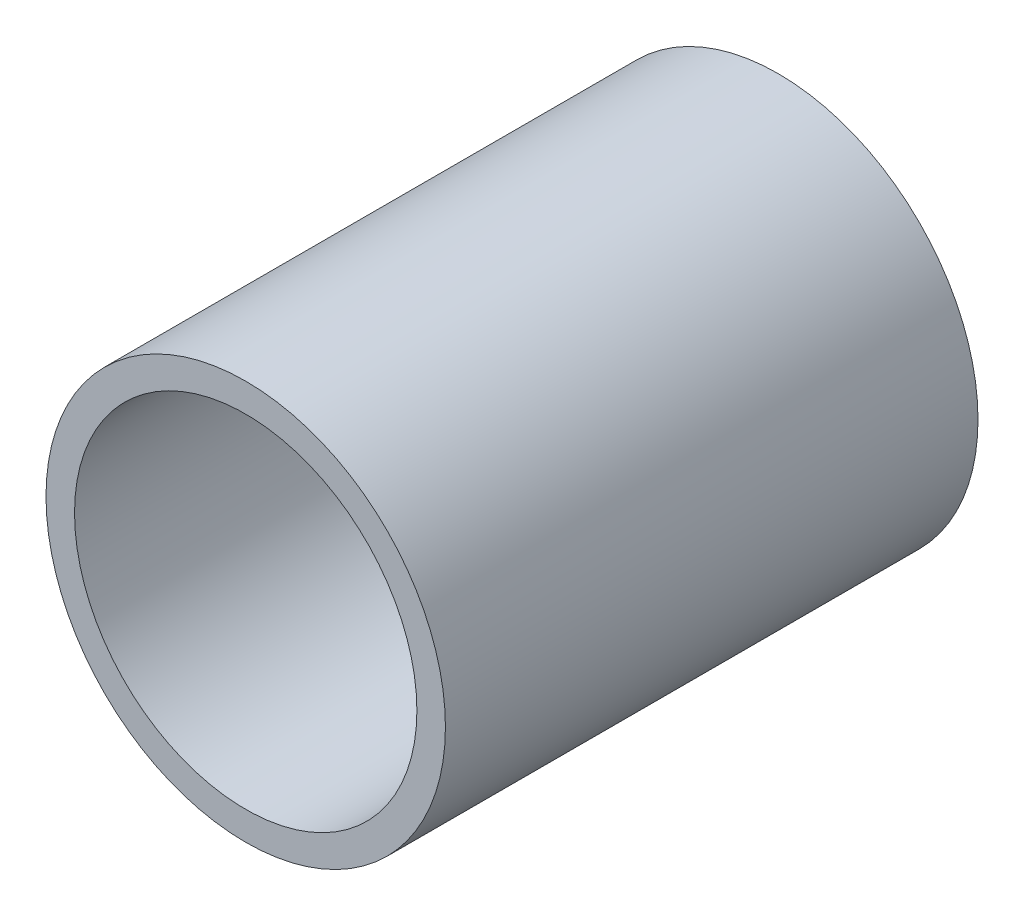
ISO-10303-21;
HEADER;
FILE_DESCRIPTION(('STEP AP214'),'2;1');
FILE_NAME('part.step','',(''),(''),'','','');
FILE_SCHEMA(('AUTOMOTIVE_DESIGN { 1 0 10303 214 1 1 1 1 }'));
ENDSEC;
DATA;
#1=APPLICATION_CONTEXT('core data for automotive mechanical design processes');
#2=APPLICATION_PROTOCOL_DEFINITION('international standard','automotive_design',2000,#1);
#3=PRODUCT_CONTEXT('',#1,'mechanical');
#4=PRODUCT('Part','Part','',(#3));
#5=PRODUCT_RELATED_PRODUCT_CATEGORY('part','',(#4));
#6=PRODUCT_DEFINITION_FORMATION('','',#4);
#7=PRODUCT_DEFINITION_CONTEXT('part definition',#1,'design');
#8=PRODUCT_DEFINITION('design','',#6,#7);
#9=PRODUCT_DEFINITION_SHAPE('','',#8);
#10=(LENGTH_UNIT() NAMED_UNIT(*) SI_UNIT(.MILLI.,.METRE.));
#11=(NAMED_UNIT(*) PLANE_ANGLE_UNIT() SI_UNIT($,.RADIAN.));
#12=(NAMED_UNIT(*) SI_UNIT($,.STERADIAN.) SOLID_ANGLE_UNIT());
#13=UNCERTAINTY_MEASURE_WITH_UNIT(LENGTH_MEASURE(1.E-05),#10,'distance_accuracy_value','');
#14=(GEOMETRIC_REPRESENTATION_CONTEXT(3) GLOBAL_UNCERTAINTY_ASSIGNED_CONTEXT((#13)) GLOBAL_UNIT_ASSIGNED_CONTEXT((#10,
#11,#12)) REPRESENTATION_CONTEXT('',''));
#15=CARTESIAN_POINT('',(0.,0.,0.));
#16=DIRECTION('',(0.,0.,1.));
#17=DIRECTION('',(1.,0.,0.));
#18=AXIS2_PLACEMENT_3D('',#15,#16,#17);
#19=CARTESIAN_POINT('',(-4.5,0.,-57.698484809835));
#20=DIRECTION('',(0.,0.,1.));
#21=DIRECTION('',(1.,0.,0.));
#22=AXIS2_PLACEMENT_3D('',#19,#20,#21);
#23=CYLINDRICAL_SURFACE('',#22,10.5);
#24=CARTESIAN_POINT('',(-4.5,0.,-28.));
#25=DIRECTION('',(0.,0.,1.));
#26=DIRECTION('',(1.,0.,0.));
#27=AXIS2_PLACEMENT_3D('',#24,#25,#26);
#28=CIRCLE('',#27,10.5);
#29=CARTESIAN_POINT('',(6.,0.,-28.));
#30=VERTEX_POINT('',#29);
#31=EDGE_CURVE('E10',#30,#30,#28,.F.);
#32=ORIENTED_EDGE('',*,*,#31,.F.);
#33=EDGE_LOOP('',(#32));
#34=FACE_BOUND('',#33,.T.);
#35=CARTESIAN_POINT('',(-4.5,0.,0.));
#36=DIRECTION('',(0.,0.,1.));
#37=DIRECTION('',(1.,0.,0.));
#38=AXIS2_PLACEMENT_3D('',#35,#36,#37);
#39=CIRCLE('',#38,10.5);
#40=CARTESIAN_POINT('',(6.,0.,0.));
#41=VERTEX_POINT('',#40);
#42=EDGE_CURVE('E40',#41,#41,#39,.T.);
#43=ORIENTED_EDGE('',*,*,#42,.F.);
#44=EDGE_LOOP('',(#43));
#45=FACE_BOUND('',#44,.T.);
#46=ADVANCED_FACE('F29',(#34,#45),#23,.T.);
#47=CARTESIAN_POINT('',(-4.5,0.,0.));
#48=DIRECTION('',(0.,0.,1.));
#49=DIRECTION('',(1.,0.,0.));
#50=AXIS2_PLACEMENT_3D('',#47,#48,#49);
#51=PLANE('',#50);
#52=CARTESIAN_POINT('',(-4.5,0.,0.));
#53=DIRECTION('',(0.,0.,1.));
#54=DIRECTION('',(1.,0.,0.));
#55=AXIS2_PLACEMENT_3D('',#52,#53,#54);
#56=CIRCLE('',#55,9.);
#57=CARTESIAN_POINT('',(4.5,0.,0.));
#58=VERTEX_POINT('',#57);
#59=EDGE_CURVE('E42',#58,#58,#56,.T.);
#60=ORIENTED_EDGE('',*,*,#59,.F.);
#61=EDGE_LOOP('',(#60));
#62=FACE_BOUND('',#61,.T.);
#63=ORIENTED_EDGE('',*,*,#42,.T.);
#64=EDGE_LOOP('',(#63));
#65=FACE_BOUND('',#64,.T.);
#66=ADVANCED_FACE('F47',(#62,#65),#51,.T.);
#67=CARTESIAN_POINT('',(-4.5,0.,-57.698484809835));
#68=DIRECTION('',(0.,0.,1.));
#69=DIRECTION('',(1.,0.,0.));
#70=AXIS2_PLACEMENT_3D('',#67,#68,#69);
#71=CYLINDRICAL_SURFACE('',#70,9.);
#72=CARTESIAN_POINT('',(-4.5,0.,-28.));
#73=DIRECTION('',(0.,0.,1.));
#74=DIRECTION('',(1.,0.,0.));
#75=AXIS2_PLACEMENT_3D('',#72,#73,#74);
#76=CIRCLE('',#75,9.);
#77=CARTESIAN_POINT('',(4.5,0.,-28.));
#78=VERTEX_POINT('',#77);
#79=EDGE_CURVE('E32',#78,#78,#76,.F.);
#80=ORIENTED_EDGE('',*,*,#79,.T.);
#81=EDGE_LOOP('',(#80));
#82=FACE_BOUND('',#81,.T.);
#83=ORIENTED_EDGE('',*,*,#59,.T.);
#84=EDGE_LOOP('',(#83));
#85=FACE_BOUND('',#84,.T.);
#86=ADVANCED_FACE('F54',(#82,#85),#71,.F.);
#87=CARTESIAN_POINT('',(17.7881605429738,12.9154887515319,-28.));
#88=DIRECTION('',(0.,0.,1.));
#89=DIRECTION('',(1.,0.,0.));
#90=AXIS2_PLACEMENT_3D('',#87,#88,#89);
#91=PLANE('',#90);
#92=ORIENTED_EDGE('',*,*,#31,.T.);
#93=EDGE_LOOP('',(#92));
#94=FACE_BOUND('',#93,.T.);
#95=ORIENTED_EDGE('',*,*,#79,.F.);
#96=EDGE_LOOP('',(#95));
#97=FACE_BOUND('',#96,.T.);
#98=ADVANCED_FACE('F59',(#94,#97),#91,.F.);
#99=CLOSED_SHELL('',(#46,#66,#86,#98));
#100=MANIFOLD_SOLID_BREP('B2',#99);
#101=ADVANCED_BREP_SHAPE_REPRESENTATION('',(#18,#100),#14);
#102=SHAPE_DEFINITION_REPRESENTATION(#9,#101);
ENDSEC;
END-ISO-10303-21;
